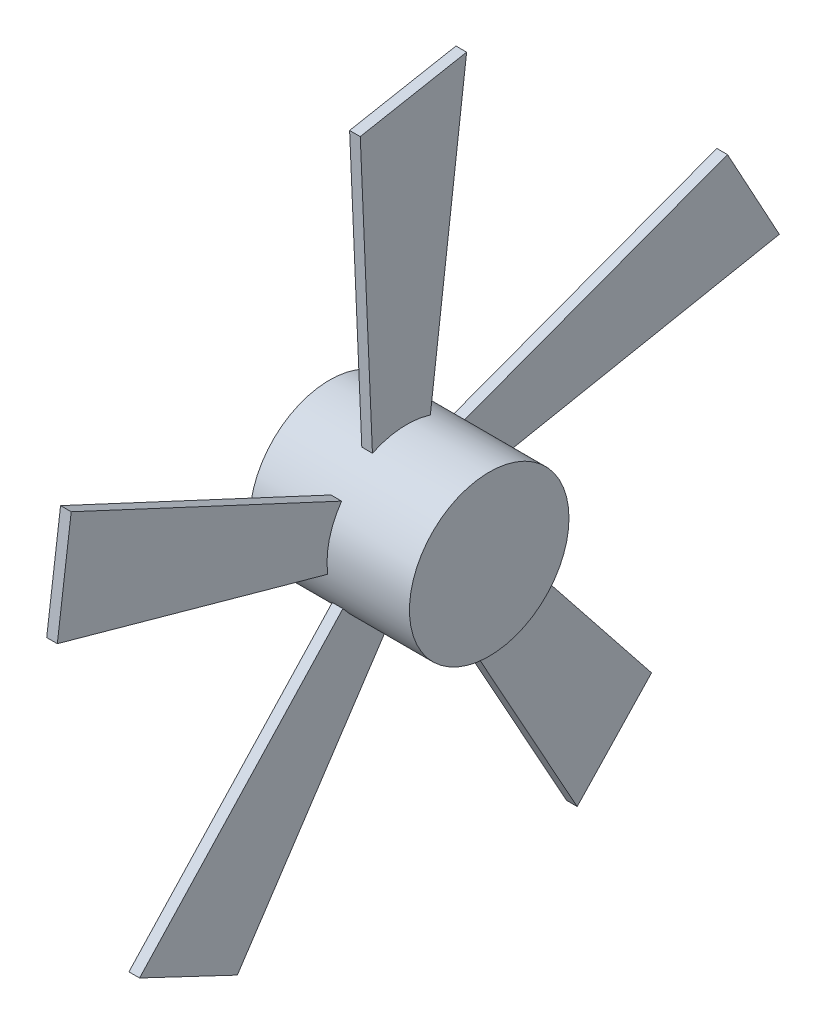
from build123d import *

# Parameters (mm, degrees)
SKETCH1_R              = 15.24
CIRCULAR_SECTION_DEPTH = 30.48
BLADE_1_DEPTH          = 2.032
BLADE_2_DEPTH          = 2.032
BLADE_3_DEPTH          = 2.032
BLADE_4_DEPTH          = 2.032
BLADE_5_DEPTH          = 2.032


with BuildPart() as part:
    # Sketch1 → Circular_section (new body)
    with BuildSketch(Plane.YZ):
        with Locations(Location((0, 0, 0), (0, 0, 90))):
            Circle(SKETCH1_R)
    extrude(amount=CIRCULAR_SECTION_DEPTH)

    # Sketch2 → Blade_1 (add)
    with BuildSketch(Plane.YZ.offset(12.7)):
        Polygon((8.89, -3.81), (71.12, -11.43), (67.31, 8.89), (8.89, 6.35), align=None)
    extrude(amount=BLADE_1_DEPTH)

    # Sketch3 → Blade_2 (add)
    with BuildSketch(Plane.YZ.offset(12.7)):
        Polygon((6.370686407, 7.277537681), (32.847864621, 64.107075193), (12.345041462, 66.762775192), (-3.292047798, 10.417150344), align=None)
    extrude(amount=BLADE_2_DEPTH)

    # Sketch4 → Blade_3 (add)
    with BuildSketch(Plane.YZ.offset(12.7)):
        Polygon((-4.952699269, 8.307765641), (-50.818903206, 51.050351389), (-59.680344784, 32.371664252), (-10.924597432, 0.088152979), align=None)
    extrude(amount=BLADE_3_DEPTH)

    # Sketch5 → Blade_4 (add)
    with BuildSketch(Plane.YZ.offset(12.7)):
        Polygon((-9.431622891, -2.143056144), (-64.255674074, -32.556222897), (-49.229522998, -46.755986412), (-3.459724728, -10.362668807), align=None)
    extrude(amount=BLADE_4_DEPTH)

    # Sketch6 → Blade_5 (add)
    with BuildSketch(Plane.YZ.offset(12.7)):
        Polygon((-0.876364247, -9.632247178), (11.106712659, -71.171203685), (29.254826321, -61.268453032), (8.786369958, -6.492634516), align=None)
    extrude(amount=BLADE_5_DEPTH)


solid = part.part
